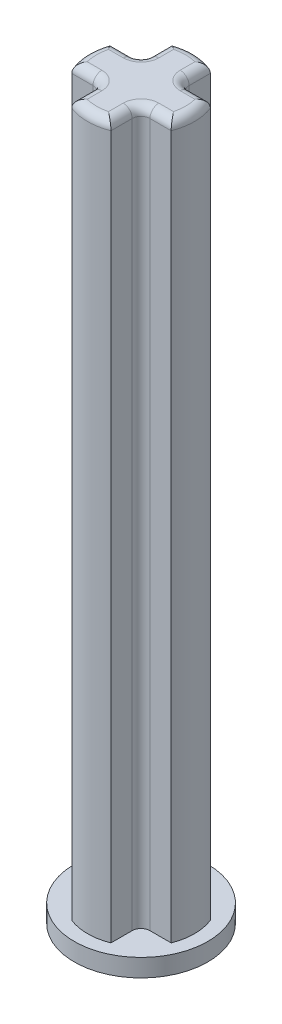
ISO-10303-21;
HEADER;
FILE_DESCRIPTION(('STEP AP214'),'2;1');
FILE_NAME('part.step','',(''),(''),'','','');
FILE_SCHEMA(('AUTOMOTIVE_DESIGN { 1 0 10303 214 1 1 1 1 }'));
ENDSEC;
DATA;
#1=APPLICATION_CONTEXT('core data for automotive mechanical design processes');
#2=APPLICATION_PROTOCOL_DEFINITION('international standard','automotive_design',2000,#1);
#3=PRODUCT_CONTEXT('',#1,'mechanical');
#4=PRODUCT('Part','Part','',(#3));
#5=PRODUCT_RELATED_PRODUCT_CATEGORY('part','',(#4));
#6=PRODUCT_DEFINITION_FORMATION('','',#4);
#7=PRODUCT_DEFINITION_CONTEXT('part definition',#1,'design');
#8=PRODUCT_DEFINITION('design','',#6,#7);
#9=PRODUCT_DEFINITION_SHAPE('','',#8);
#10=(LENGTH_UNIT() NAMED_UNIT(*) SI_UNIT(.MILLI.,.METRE.));
#11=(NAMED_UNIT(*) PLANE_ANGLE_UNIT() SI_UNIT($,.RADIAN.));
#12=(NAMED_UNIT(*) SI_UNIT($,.STERADIAN.) SOLID_ANGLE_UNIT());
#13=UNCERTAINTY_MEASURE_WITH_UNIT(LENGTH_MEASURE(1.E-05),#10,'distance_accuracy_value','');
#14=(GEOMETRIC_REPRESENTATION_CONTEXT(3) GLOBAL_UNCERTAINTY_ASSIGNED_CONTEXT((#13)) GLOBAL_UNIT_ASSIGNED_CONTEXT((#10,
#11,#12)) REPRESENTATION_CONTEXT('',''));
#15=CARTESIAN_POINT('',(0.,0.,0.));
#16=DIRECTION('',(0.,0.,1.));
#17=DIRECTION('',(1.,0.,0.));
#18=AXIS2_PLACEMENT_3D('',#15,#16,#17);
#19=CARTESIAN_POINT('',(-0.88,32.,-2.23284571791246));
#20=DIRECTION('',(1.,0.,0.));
#21=DIRECTION('',(0.,0.,-1.));
#22=AXIS2_PLACEMENT_3D('',#19,#20,#21);
#23=PLANE('',#22);
#24=DIRECTION('',(0.,-1.,0.));
#25=VECTOR('',#24,1.);
#26=CARTESIAN_POINT('',(-0.88,32.,-1.28));
#27=LINE('',#26,#25);
#28=CARTESIAN_POINT('',(-0.88,0.,-1.28));
#29=VERTEX_POINT('',#28);
#30=CARTESIAN_POINT('',(-0.88,31.6,-1.28));
#31=VERTEX_POINT('',#30);
#32=EDGE_CURVE('E62',#29,#31,#27,.F.);
#33=ORIENTED_EDGE('',*,*,#32,.T.);
#34=DIRECTION('',(0.,0.,1.));
#35=VECTOR('',#34,1.);
#36=CARTESIAN_POINT('',(-0.88,31.6,-2.23284571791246));
#37=LINE('',#36,#35);
#38=CARTESIAN_POINT('',(-0.88,31.6,-2.23284571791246));
#39=VERTEX_POINT('',#38);
#40=EDGE_CURVE('E214',#31,#39,#37,.F.);
#41=ORIENTED_EDGE('',*,*,#40,.T.);
#42=DIRECTION('',(0.,-1.,0.));
#43=VECTOR('',#42,1.);
#44=CARTESIAN_POINT('',(-0.88,32.,-2.23284571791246));
#45=LINE('',#44,#43);
#46=CARTESIAN_POINT('',(-0.88,0.,-2.23284571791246));
#47=VERTEX_POINT('',#46);
#48=EDGE_CURVE('E219',#39,#47,#45,.T.);
#49=ORIENTED_EDGE('',*,*,#48,.T.);
#50=DIRECTION('',(0.,0.,1.));
#51=VECTOR('',#50,1.);
#52=CARTESIAN_POINT('',(-0.88,0.,-2.23284571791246));
#53=LINE('',#52,#51);
#54=EDGE_CURVE('E217',#47,#29,#53,.T.);
#55=ORIENTED_EDGE('',*,*,#54,.T.);
#56=EDGE_LOOP('',(#33,#41,#49,#55));
#57=FACE_BOUND('',#56,.T.);
#58=ADVANCED_FACE('F39',(#57),#23,.F.);
#59=CARTESIAN_POINT('',(-2.23284571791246,32.,-0.88));
#60=DIRECTION('',(0.,0.,1.));
#61=DIRECTION('',(1.,0.,0.));
#62=AXIS2_PLACEMENT_3D('',#59,#60,#61);
#63=PLANE('',#62);
#64=DIRECTION('',(0.,-1.,0.));
#65=VECTOR('',#64,1.);
#66=CARTESIAN_POINT('',(-2.23284571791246,32.,-0.88));
#67=LINE('',#66,#65);
#68=CARTESIAN_POINT('',(-2.23284571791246,31.6,-0.88));
#69=VERTEX_POINT('',#68);
#70=CARTESIAN_POINT('',(-2.23284571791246,0.,-0.88));
#71=VERTEX_POINT('',#70);
#72=EDGE_CURVE('E291',#69,#71,#67,.T.);
#73=ORIENTED_EDGE('',*,*,#72,.F.);
#74=DIRECTION('',(-1.,0.,0.));
#75=VECTOR('',#74,1.);
#76=CARTESIAN_POINT('',(-0.88,31.6,-0.88));
#77=LINE('',#76,#75);
#78=CARTESIAN_POINT('',(-1.28,31.6,-0.88));
#79=VERTEX_POINT('',#78);
#80=EDGE_CURVE('E70',#69,#79,#77,.F.);
#81=ORIENTED_EDGE('',*,*,#80,.T.);
#82=DIRECTION('',(0.,-1.,0.));
#83=VECTOR('',#82,1.);
#84=CARTESIAN_POINT('',(-1.28,0.,-0.88));
#85=LINE('',#84,#83);
#86=CARTESIAN_POINT('',(-1.28,0.,-0.88));
#87=VERTEX_POINT('',#86);
#88=EDGE_CURVE('E396',#79,#87,#85,.T.);
#89=ORIENTED_EDGE('',*,*,#88,.T.);
#90=DIRECTION('',(-1.,0.,0.));
#91=VECTOR('',#90,1.);
#92=CARTESIAN_POINT('',(-2.23284571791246,0.,-0.88));
#93=LINE('',#92,#91);
#94=EDGE_CURVE('E224',#87,#71,#93,.T.);
#95=ORIENTED_EDGE('',*,*,#94,.T.);
#96=EDGE_LOOP('',(#73,#81,#89,#95));
#97=FACE_BOUND('',#96,.T.);
#98=ADVANCED_FACE('F572',(#97),#63,.F.);
#99=CARTESIAN_POINT('',(0.,32.,0.));
#100=DIRECTION('',(0.,-1.,0.));
#101=DIRECTION('',(0.,0.,-1.));
#102=AXIS2_PLACEMENT_3D('',#99,#100,#101);
#103=CYLINDRICAL_SURFACE('',#102,2.4);
#104=DIRECTION('',(0.,-1.,0.));
#105=VECTOR('',#104,1.);
#106=CARTESIAN_POINT('',(-2.23284571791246,32.,0.880000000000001));
#107=LINE('',#106,#105);
#108=CARTESIAN_POINT('',(-2.23284571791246,31.6,0.880000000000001));
#109=VERTEX_POINT('',#108);
#110=CARTESIAN_POINT('',(-2.23284571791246,0.,0.880000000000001));
#111=VERTEX_POINT('',#110);
#112=EDGE_CURVE('E288',#109,#111,#107,.T.);
#113=ORIENTED_EDGE('',*,*,#112,.F.);
#114=CARTESIAN_POINT('',(0.,31.6,0.));
#115=DIRECTION('',(0.,1.,0.));
#116=DIRECTION('',(0.,0.,1.));
#117=AXIS2_PLACEMENT_3D('',#114,#115,#116);
#118=CIRCLE('',#117,2.4);
#119=EDGE_CURVE('E393',#109,#69,#118,.F.);
#120=ORIENTED_EDGE('',*,*,#119,.T.);
#121=ORIENTED_EDGE('',*,*,#72,.T.);
#122=CARTESIAN_POINT('',(0.,0.,0.));
#123=DIRECTION('',(0.,1.,0.));
#124=DIRECTION('',(0.,0.,1.));
#125=AXIS2_PLACEMENT_3D('',#122,#123,#124);
#126=CIRCLE('',#125,2.4);
#127=EDGE_CURVE('E231',#71,#111,#126,.T.);
#128=ORIENTED_EDGE('',*,*,#127,.T.);
#129=EDGE_LOOP('',(#113,#120,#121,#128));
#130=FACE_BOUND('',#129,.T.);
#131=ADVANCED_FACE('F576',(#130),#103,.T.);
#132=CARTESIAN_POINT('',(-0.88,32.,0.880000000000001));
#133=DIRECTION('',(0.,0.,-1.));
#134=DIRECTION('',(-1.,0.,0.));
#135=AXIS2_PLACEMENT_3D('',#132,#133,#134);
#136=PLANE('',#135);
#137=DIRECTION('',(0.,-1.,0.));
#138=VECTOR('',#137,1.);
#139=CARTESIAN_POINT('',(-1.28,32.,0.880000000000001));
#140=LINE('',#139,#138);
#141=CARTESIAN_POINT('',(-1.28,0.,0.880000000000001));
#142=VERTEX_POINT('',#141);
#143=CARTESIAN_POINT('',(-1.28,31.6,0.880000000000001));
#144=VERTEX_POINT('',#143);
#145=EDGE_CURVE('E387',#142,#144,#140,.F.);
#146=ORIENTED_EDGE('',*,*,#145,.T.);
#147=DIRECTION('',(1.,0.,0.));
#148=VECTOR('',#147,1.);
#149=CARTESIAN_POINT('',(-2.23284571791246,31.6,0.880000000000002));
#150=LINE('',#149,#148);
#151=EDGE_CURVE('E390',#144,#109,#150,.F.);
#152=ORIENTED_EDGE('',*,*,#151,.T.);
#153=ORIENTED_EDGE('',*,*,#112,.T.);
#154=DIRECTION('',(1.,0.,0.));
#155=VECTOR('',#154,1.);
#156=CARTESIAN_POINT('',(-0.88,0.,0.880000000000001));
#157=LINE('',#156,#155);
#158=EDGE_CURVE('E236',#111,#142,#157,.T.);
#159=ORIENTED_EDGE('',*,*,#158,.T.);
#160=EDGE_LOOP('',(#146,#152,#153,#159));
#161=FACE_BOUND('',#160,.T.);
#162=ADVANCED_FACE('F581',(#161),#136,.F.);
#163=CARTESIAN_POINT('',(-0.88,32.,0.880000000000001));
#164=DIRECTION('',(1.,0.,0.));
#165=DIRECTION('',(0.,0.,-1.));
#166=AXIS2_PLACEMENT_3D('',#163,#164,#165);
#167=PLANE('',#166);
#168=DIRECTION('',(0.,-1.,0.));
#169=VECTOR('',#168,1.);
#170=CARTESIAN_POINT('',(-0.88,32.,2.23284571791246));
#171=LINE('',#170,#169);
#172=CARTESIAN_POINT('',(-0.88,31.6,2.23284571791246));
#173=VERTEX_POINT('',#172);
#174=CARTESIAN_POINT('',(-0.88,0.,2.23284571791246));
#175=VERTEX_POINT('',#174);
#176=EDGE_CURVE('E284',#173,#175,#171,.T.);
#177=ORIENTED_EDGE('',*,*,#176,.F.);
#178=DIRECTION('',(0.,0.,1.));
#179=VECTOR('',#178,1.);
#180=CARTESIAN_POINT('',(-0.88,31.6,0.880000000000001));
#181=LINE('',#180,#179);
#182=CARTESIAN_POINT('',(-0.88,31.6,1.28));
#183=VERTEX_POINT('',#182);
#184=EDGE_CURVE('E384',#173,#183,#181,.F.);
#185=ORIENTED_EDGE('',*,*,#184,.T.);
#186=DIRECTION('',(0.,-1.,0.));
#187=VECTOR('',#186,1.);
#188=CARTESIAN_POINT('',(-0.88,0.,1.28));
#189=LINE('',#188,#187);
#190=CARTESIAN_POINT('',(-0.88,0.,1.28));
#191=VERTEX_POINT('',#190);
#192=EDGE_CURVE('E381',#183,#191,#189,.T.);
#193=ORIENTED_EDGE('',*,*,#192,.T.);
#194=DIRECTION('',(0.,0.,1.));
#195=VECTOR('',#194,1.);
#196=CARTESIAN_POINT('',(-0.88,0.,0.880000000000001));
#197=LINE('',#196,#195);
#198=EDGE_CURVE('E242',#191,#175,#197,.T.);
#199=ORIENTED_EDGE('',*,*,#198,.T.);
#200=EDGE_LOOP('',(#177,#185,#193,#199));
#201=FACE_BOUND('',#200,.T.);
#202=ADVANCED_FACE('F585',(#201),#167,.F.);
#203=CARTESIAN_POINT('',(0.,32.,0.));
#204=DIRECTION('',(0.,-1.,0.));
#205=DIRECTION('',(0.,0.,-1.));
#206=AXIS2_PLACEMENT_3D('',#203,#204,#205);
#207=CYLINDRICAL_SURFACE('',#206,2.4);
#208=DIRECTION('',(0.,-1.,0.));
#209=VECTOR('',#208,1.);
#210=CARTESIAN_POINT('',(0.88,32.,2.23284571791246));
#211=LINE('',#210,#209);
#212=CARTESIAN_POINT('',(0.88,31.6,2.23284571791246));
#213=VERTEX_POINT('',#212);
#214=CARTESIAN_POINT('',(0.88,0.,2.23284571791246));
#215=VERTEX_POINT('',#214);
#216=EDGE_CURVE('E281',#213,#215,#211,.T.);
#217=ORIENTED_EDGE('',*,*,#216,.F.);
#218=CARTESIAN_POINT('',(0.,31.6,0.));
#219=DIRECTION('',(0.,1.,0.));
#220=DIRECTION('',(0.,0.,1.));
#221=AXIS2_PLACEMENT_3D('',#218,#219,#220);
#222=CIRCLE('',#221,2.4);
#223=EDGE_CURVE('E378',#213,#173,#222,.F.);
#224=ORIENTED_EDGE('',*,*,#223,.T.);
#225=ORIENTED_EDGE('',*,*,#176,.T.);
#226=CARTESIAN_POINT('',(0.,0.,0.));
#227=DIRECTION('',(0.,1.,0.));
#228=DIRECTION('',(0.,0.,1.));
#229=AXIS2_PLACEMENT_3D('',#226,#227,#228);
#230=CIRCLE('',#229,2.4);
#231=EDGE_CURVE('E245',#175,#215,#230,.T.);
#232=ORIENTED_EDGE('',*,*,#231,.T.);
#233=EDGE_LOOP('',(#217,#224,#225,#232));
#234=FACE_BOUND('',#233,.T.);
#235=ADVANCED_FACE('F589',(#234),#207,.T.);
#236=CARTESIAN_POINT('',(0.880000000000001,32.,2.23284571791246));
#237=DIRECTION('',(-1.,0.,0.));
#238=DIRECTION('',(0.,0.,1.));
#239=AXIS2_PLACEMENT_3D('',#236,#237,#238);
#240=PLANE('',#239);
#241=DIRECTION('',(0.,-1.,0.));
#242=VECTOR('',#241,1.);
#243=CARTESIAN_POINT('',(0.880000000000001,32.,1.28));
#244=LINE('',#243,#242);
#245=CARTESIAN_POINT('',(0.880000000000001,0.,1.28));
#246=VERTEX_POINT('',#245);
#247=CARTESIAN_POINT('',(0.880000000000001,31.6,1.28));
#248=VERTEX_POINT('',#247);
#249=EDGE_CURVE('E372',#246,#248,#244,.F.);
#250=ORIENTED_EDGE('',*,*,#249,.T.);
#251=DIRECTION('',(0.,0.,-1.));
#252=VECTOR('',#251,1.);
#253=CARTESIAN_POINT('',(0.880000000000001,31.6,2.23284571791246));
#254=LINE('',#253,#252);
#255=EDGE_CURVE('E375',#248,#213,#254,.F.);
#256=ORIENTED_EDGE('',*,*,#255,.T.);
#257=ORIENTED_EDGE('',*,*,#216,.T.);
#258=DIRECTION('',(0.,0.,-1.));
#259=VECTOR('',#258,1.);
#260=CARTESIAN_POINT('',(0.880000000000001,0.,2.23284571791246));
#261=LINE('',#260,#259);
#262=EDGE_CURVE('E249',#215,#246,#261,.T.);
#263=ORIENTED_EDGE('',*,*,#262,.T.);
#264=EDGE_LOOP('',(#250,#256,#257,#263));
#265=FACE_BOUND('',#264,.T.);
#266=ADVANCED_FACE('F593',(#265),#240,.F.);
#267=CARTESIAN_POINT('',(2.23284571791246,32.,0.880000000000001));
#268=DIRECTION('',(0.,0.,-1.));
#269=DIRECTION('',(-1.,0.,0.));
#270=AXIS2_PLACEMENT_3D('',#267,#268,#269);
#271=PLANE('',#270);
#272=DIRECTION('',(0.,-1.,0.));
#273=VECTOR('',#272,1.);
#274=CARTESIAN_POINT('',(2.23284571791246,32.,0.880000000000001));
#275=LINE('',#274,#273);
#276=CARTESIAN_POINT('',(2.23284571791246,31.6,0.880000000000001));
#277=VERTEX_POINT('',#276);
#278=CARTESIAN_POINT('',(2.23284571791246,0.,0.880000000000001));
#279=VERTEX_POINT('',#278);
#280=EDGE_CURVE('E277',#277,#279,#275,.T.);
#281=ORIENTED_EDGE('',*,*,#280,.F.);
#282=DIRECTION('',(1.,0.,0.));
#283=VECTOR('',#282,1.);
#284=CARTESIAN_POINT('',(0.880000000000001,31.6,0.880000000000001));
#285=LINE('',#284,#283);
#286=CARTESIAN_POINT('',(1.28,31.6,0.880000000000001));
#287=VERTEX_POINT('',#286);
#288=EDGE_CURVE('E369',#277,#287,#285,.F.);
#289=ORIENTED_EDGE('',*,*,#288,.T.);
#290=DIRECTION('',(0.,-1.,0.));
#291=VECTOR('',#290,1.);
#292=CARTESIAN_POINT('',(1.28,0.,0.880000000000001));
#293=LINE('',#292,#291);
#294=CARTESIAN_POINT('',(1.28,0.,0.880000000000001));
#295=VERTEX_POINT('',#294);
#296=EDGE_CURVE('E366',#287,#295,#293,.T.);
#297=ORIENTED_EDGE('',*,*,#296,.T.);
#298=DIRECTION('',(1.,0.,0.));
#299=VECTOR('',#298,1.);
#300=CARTESIAN_POINT('',(2.23284571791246,0.,0.880000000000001));
#301=LINE('',#300,#299);
#302=EDGE_CURVE('E252',#295,#279,#301,.T.);
#303=ORIENTED_EDGE('',*,*,#302,.T.);
#304=EDGE_LOOP('',(#281,#289,#297,#303));
#305=FACE_BOUND('',#304,.T.);
#306=ADVANCED_FACE('F597',(#305),#271,.F.);
#307=CARTESIAN_POINT('',(0.,32.,0.));
#308=DIRECTION('',(0.,-1.,0.));
#309=DIRECTION('',(0.,0.,-1.));
#310=AXIS2_PLACEMENT_3D('',#307,#308,#309);
#311=CYLINDRICAL_SURFACE('',#310,2.4);
#312=DIRECTION('',(0.,-1.,0.));
#313=VECTOR('',#312,1.);
#314=CARTESIAN_POINT('',(2.23284571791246,32.,-0.88));
#315=LINE('',#314,#313);
#316=CARTESIAN_POINT('',(2.23284571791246,31.6,-0.88));
#317=VERTEX_POINT('',#316);
#318=CARTESIAN_POINT('',(2.23284571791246,0.,-0.88));
#319=VERTEX_POINT('',#318);
#320=EDGE_CURVE('E274',#317,#319,#315,.T.);
#321=ORIENTED_EDGE('',*,*,#320,.F.);
#322=CARTESIAN_POINT('',(0.,31.6,0.));
#323=DIRECTION('',(0.,1.,0.));
#324=DIRECTION('',(0.,0.,1.));
#325=AXIS2_PLACEMENT_3D('',#322,#323,#324);
#326=CIRCLE('',#325,2.4);
#327=EDGE_CURVE('E363',#317,#277,#326,.F.);
#328=ORIENTED_EDGE('',*,*,#327,.T.);
#329=ORIENTED_EDGE('',*,*,#280,.T.);
#330=CARTESIAN_POINT('',(0.,0.,0.));
#331=DIRECTION('',(0.,1.,0.));
#332=DIRECTION('',(0.,0.,1.));
#333=AXIS2_PLACEMENT_3D('',#330,#331,#332);
#334=CIRCLE('',#333,2.4);
#335=EDGE_CURVE('E255',#279,#319,#334,.T.);
#336=ORIENTED_EDGE('',*,*,#335,.T.);
#337=EDGE_LOOP('',(#321,#328,#329,#336));
#338=FACE_BOUND('',#337,.T.);
#339=ADVANCED_FACE('F601',(#338),#311,.T.);
#340=CARTESIAN_POINT('',(0.880000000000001,32.,-0.88));
#341=DIRECTION('',(0.,0.,1.));
#342=DIRECTION('',(1.,0.,0.));
#343=AXIS2_PLACEMENT_3D('',#340,#341,#342);
#344=PLANE('',#343);
#345=DIRECTION('',(0.,-1.,0.));
#346=VECTOR('',#345,1.);
#347=CARTESIAN_POINT('',(1.28,32.,-0.88));
#348=LINE('',#347,#346);
#349=CARTESIAN_POINT('',(1.28,0.,-0.88));
#350=VERTEX_POINT('',#349);
#351=CARTESIAN_POINT('',(1.28,31.6,-0.88));
#352=VERTEX_POINT('',#351);
#353=EDGE_CURVE('E357',#350,#352,#348,.F.);
#354=ORIENTED_EDGE('',*,*,#353,.T.);
#355=DIRECTION('',(-1.,0.,0.));
#356=VECTOR('',#355,1.);
#357=CARTESIAN_POINT('',(2.23284571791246,31.6,-0.88));
#358=LINE('',#357,#356);
#359=EDGE_CURVE('E360',#352,#317,#358,.F.);
#360=ORIENTED_EDGE('',*,*,#359,.T.);
#361=ORIENTED_EDGE('',*,*,#320,.T.);
#362=DIRECTION('',(-1.,0.,0.));
#363=VECTOR('',#362,1.);
#364=CARTESIAN_POINT('',(0.880000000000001,0.,-0.88));
#365=LINE('',#364,#363);
#366=EDGE_CURVE('E259',#319,#350,#365,.T.);
#367=ORIENTED_EDGE('',*,*,#366,.T.);
#368=EDGE_LOOP('',(#354,#360,#361,#367));
#369=FACE_BOUND('',#368,.T.);
#370=ADVANCED_FACE('F605',(#369),#344,.F.);
#371=CARTESIAN_POINT('',(0.880000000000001,32.,-0.88));
#372=DIRECTION('',(-1.,0.,0.));
#373=DIRECTION('',(0.,0.,1.));
#374=AXIS2_PLACEMENT_3D('',#371,#372,#373);
#375=PLANE('',#374);
#376=DIRECTION('',(0.,-1.,0.));
#377=VECTOR('',#376,1.);
#378=CARTESIAN_POINT('',(0.880000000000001,32.,-2.23284571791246));
#379=LINE('',#378,#377);
#380=CARTESIAN_POINT('',(0.880000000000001,31.6,-2.23284571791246));
#381=VERTEX_POINT('',#380);
#382=CARTESIAN_POINT('',(0.880000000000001,0.,-2.23284571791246));
#383=VERTEX_POINT('',#382);
#384=EDGE_CURVE('E270',#381,#383,#379,.T.);
#385=ORIENTED_EDGE('',*,*,#384,.F.);
#386=DIRECTION('',(0.,0.,-1.));
#387=VECTOR('',#386,1.);
#388=CARTESIAN_POINT('',(0.880000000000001,31.6,-0.88));
#389=LINE('',#388,#387);
#390=CARTESIAN_POINT('',(0.880000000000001,31.6,-1.28));
#391=VERTEX_POINT('',#390);
#392=EDGE_CURVE('E354',#381,#391,#389,.F.);
#393=ORIENTED_EDGE('',*,*,#392,.T.);
#394=DIRECTION('',(0.,-1.,0.));
#395=VECTOR('',#394,1.);
#396=CARTESIAN_POINT('',(0.880000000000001,0.,-1.28));
#397=LINE('',#396,#395);
#398=CARTESIAN_POINT('',(0.880000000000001,0.,-1.28));
#399=VERTEX_POINT('',#398);
#400=EDGE_CURVE('E351',#391,#399,#397,.T.);
#401=ORIENTED_EDGE('',*,*,#400,.T.);
#402=DIRECTION('',(0.,0.,-1.));
#403=VECTOR('',#402,1.);
#404=CARTESIAN_POINT('',(0.880000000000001,0.,-0.88));
#405=LINE('',#404,#403);
#406=EDGE_CURVE('E262',#399,#383,#405,.T.);
#407=ORIENTED_EDGE('',*,*,#406,.T.);
#408=EDGE_LOOP('',(#385,#393,#401,#407));
#409=FACE_BOUND('',#408,.T.);
#410=ADVANCED_FACE('F609',(#409),#375,.F.);
#411=CARTESIAN_POINT('',(0.,32.,0.));
#412=DIRECTION('',(0.,-1.,0.));
#413=DIRECTION('',(0.,0.,-1.));
#414=AXIS2_PLACEMENT_3D('',#411,#412,#413);
#415=CYLINDRICAL_SURFACE('',#414,2.4);
#416=ORIENTED_EDGE('',*,*,#48,.F.);
#417=CARTESIAN_POINT('',(0.,31.6,0.));
#418=DIRECTION('',(0.,1.,0.));
#419=DIRECTION('',(0.,0.,1.));
#420=AXIS2_PLACEMENT_3D('',#417,#418,#419);
#421=CIRCLE('',#420,2.4);
#422=EDGE_CURVE('E347',#39,#381,#421,.F.);
#423=ORIENTED_EDGE('',*,*,#422,.T.);
#424=ORIENTED_EDGE('',*,*,#384,.T.);
#425=CARTESIAN_POINT('',(0.,0.,0.));
#426=DIRECTION('',(0.,1.,0.));
#427=DIRECTION('',(0.,0.,1.));
#428=AXIS2_PLACEMENT_3D('',#425,#426,#427);
#429=CIRCLE('',#428,2.4);
#430=EDGE_CURVE('E265',#383,#47,#429,.T.);
#431=ORIENTED_EDGE('',*,*,#430,.T.);
#432=EDGE_LOOP('',(#416,#423,#424,#431));
#433=FACE_BOUND('',#432,.T.);
#434=ADVANCED_FACE('F613',(#433),#415,.T.);
#435=CARTESIAN_POINT('',(0.,32.,0.));
#436=DIRECTION('',(0.,1.,0.));
#437=DIRECTION('',(0.,0.,1.));
#438=AXIS2_PLACEMENT_3D('',#435,#436,#437);
#439=PLANE('',#438);
#440=CARTESIAN_POINT('',(0.,32.,0.));
#441=DIRECTION('',(0.,1.,0.));
#442=DIRECTION('',(0.,0.,1.));
#443=AXIS2_PLACEMENT_3D('',#440,#441,#442);
#444=CIRCLE('',#443,2.);
#445=CARTESIAN_POINT('',(1.94154577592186,32.,0.480000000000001));
#446=VERTEX_POINT('',#445);
#447=CARTESIAN_POINT('',(1.94154577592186,32.,-0.48));
#448=VERTEX_POINT('',#447);
#449=EDGE_CURVE('E337',#446,#448,#444,.T.);
#450=ORIENTED_EDGE('',*,*,#449,.T.);
#451=DIRECTION('',(-1.,0.,0.));
#452=VECTOR('',#451,1.);
#453=CARTESIAN_POINT('',(0.880000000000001,32.,-0.48));
#454=LINE('',#453,#452);
#455=CARTESIAN_POINT('',(1.28,32.,-0.48));
#456=VERTEX_POINT('',#455);
#457=EDGE_CURVE('E344',#448,#456,#454,.T.);
#458=ORIENTED_EDGE('',*,*,#457,.T.);
#459=CARTESIAN_POINT('',(1.28,32.,-1.28));
#460=DIRECTION('',(0.,1.,0.));
#461=DIRECTION('',(0.,0.,1.));
#462=AXIS2_PLACEMENT_3D('',#459,#460,#461);
#463=CIRCLE('',#462,0.8);
#464=CARTESIAN_POINT('',(0.480000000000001,32.,-1.28));
#465=VERTEX_POINT('',#464);
#466=EDGE_CURVE('E340',#465,#456,#463,.T.);
#467=ORIENTED_EDGE('',*,*,#466,.F.);
#468=DIRECTION('',(0.,0.,-1.));
#469=VECTOR('',#468,1.);
#470=CARTESIAN_POINT('',(0.480000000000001,32.,-2.23284571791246));
#471=LINE('',#470,#469);
#472=CARTESIAN_POINT('',(0.480000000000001,32.,-1.94154577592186));
#473=VERTEX_POINT('',#472);
#474=EDGE_CURVE('E327',#465,#473,#471,.T.);
#475=ORIENTED_EDGE('',*,*,#474,.T.);
#476=CARTESIAN_POINT('',(0.,32.,0.));
#477=DIRECTION('',(0.,1.,0.));
#478=DIRECTION('',(0.,0.,1.));
#479=AXIS2_PLACEMENT_3D('',#476,#477,#478);
#480=CIRCLE('',#479,2.);
#481=CARTESIAN_POINT('',(-0.48,32.,-1.94154577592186));
#482=VERTEX_POINT('',#481);
#483=EDGE_CURVE('E310',#473,#482,#480,.T.);
#484=ORIENTED_EDGE('',*,*,#483,.T.);
#485=DIRECTION('',(0.,0.,1.));
#486=VECTOR('',#485,1.);
#487=CARTESIAN_POINT('',(-0.48,32.,-0.88));
#488=LINE('',#487,#486);
#489=CARTESIAN_POINT('',(-0.48,32.,-1.28));
#490=VERTEX_POINT('',#489);
#491=EDGE_CURVE('E298',#482,#490,#488,.T.);
#492=ORIENTED_EDGE('',*,*,#491,.T.);
#493=CARTESIAN_POINT('',(-1.28,32.,-1.28));
#494=DIRECTION('',(0.,1.,0.));
#495=DIRECTION('',(0.,0.,1.));
#496=AXIS2_PLACEMENT_3D('',#493,#494,#495);
#497=CIRCLE('',#496,0.8);
#498=CARTESIAN_POINT('',(-1.28,32.,-0.48));
#499=VERTEX_POINT('',#498);
#500=EDGE_CURVE('E294',#499,#490,#497,.T.);
#501=ORIENTED_EDGE('',*,*,#500,.F.);
#502=DIRECTION('',(-1.,0.,0.));
#503=VECTOR('',#502,1.);
#504=CARTESIAN_POINT('',(-2.23284571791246,32.,-0.48));
#505=LINE('',#504,#503);
#506=CARTESIAN_POINT('',(-1.94154577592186,32.,-0.48));
#507=VERTEX_POINT('',#506);
#508=EDGE_CURVE('E301',#499,#507,#505,.T.);
#509=ORIENTED_EDGE('',*,*,#508,.T.);
#510=CARTESIAN_POINT('',(0.,32.,0.));
#511=DIRECTION('',(0.,1.,0.));
#512=DIRECTION('',(0.,0.,1.));
#513=AXIS2_PLACEMENT_3D('',#510,#511,#512);
#514=CIRCLE('',#513,2.);
#515=CARTESIAN_POINT('',(-1.94154577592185,32.,0.480000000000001));
#516=VERTEX_POINT('',#515);
#517=EDGE_CURVE('E304',#507,#516,#514,.T.);
#518=ORIENTED_EDGE('',*,*,#517,.T.);
#519=DIRECTION('',(1.,0.,0.));
#520=VECTOR('',#519,1.);
#521=CARTESIAN_POINT('',(-0.88,32.,0.480000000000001));
#522=LINE('',#521,#520);
#523=CARTESIAN_POINT('',(-1.28,32.,0.480000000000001));
#524=VERTEX_POINT('',#523);
#525=EDGE_CURVE('E307',#516,#524,#522,.T.);
#526=ORIENTED_EDGE('',*,*,#525,.T.);
#527=CARTESIAN_POINT('',(-1.28,32.,1.28));
#528=DIRECTION('',(0.,1.,0.));
#529=DIRECTION('',(0.,0.,1.));
#530=AXIS2_PLACEMENT_3D('',#527,#528,#529);
#531=CIRCLE('',#530,0.8);
#532=CARTESIAN_POINT('',(-0.48,32.,1.28));
#533=VERTEX_POINT('',#532);
#534=EDGE_CURVE('E314',#533,#524,#531,.T.);
#535=ORIENTED_EDGE('',*,*,#534,.F.);
#536=DIRECTION('',(0.,0.,1.));
#537=VECTOR('',#536,1.);
#538=CARTESIAN_POINT('',(-0.48,32.,2.23284571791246));
#539=LINE('',#538,#537);
#540=CARTESIAN_POINT('',(-0.48,32.,1.94154577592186));
#541=VERTEX_POINT('',#540);
#542=EDGE_CURVE('E318',#533,#541,#539,.T.);
#543=ORIENTED_EDGE('',*,*,#542,.T.);
#544=CARTESIAN_POINT('',(0.,32.,0.));
#545=DIRECTION('',(0.,1.,0.));
#546=DIRECTION('',(0.,0.,1.));
#547=AXIS2_PLACEMENT_3D('',#544,#545,#546);
#548=CIRCLE('',#547,2.);
#549=CARTESIAN_POINT('',(0.48,32.,1.94154577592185));
#550=VERTEX_POINT('',#549);
#551=EDGE_CURVE('E321',#541,#550,#548,.T.);
#552=ORIENTED_EDGE('',*,*,#551,.T.);
#553=DIRECTION('',(0.,0.,-1.));
#554=VECTOR('',#553,1.);
#555=CARTESIAN_POINT('',(0.480000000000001,32.,0.880000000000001));
#556=LINE('',#555,#554);
#557=CARTESIAN_POINT('',(0.480000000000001,32.,1.28));
#558=VERTEX_POINT('',#557);
#559=EDGE_CURVE('E324',#550,#558,#556,.T.);
#560=ORIENTED_EDGE('',*,*,#559,.T.);
#561=CARTESIAN_POINT('',(1.28,32.,1.28));
#562=DIRECTION('',(0.,1.,0.));
#563=DIRECTION('',(0.,0.,1.));
#564=AXIS2_PLACEMENT_3D('',#561,#562,#563);
#565=CIRCLE('',#564,0.8);
#566=CARTESIAN_POINT('',(1.28,32.,0.480000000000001));
#567=VERTEX_POINT('',#566);
#568=EDGE_CURVE('E330',#567,#558,#565,.T.);
#569=ORIENTED_EDGE('',*,*,#568,.F.);
#570=DIRECTION('',(1.,0.,0.));
#571=VECTOR('',#570,1.);
#572=CARTESIAN_POINT('',(2.23284571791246,32.,0.480000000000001));
#573=LINE('',#572,#571);
#574=EDGE_CURVE('E334',#567,#446,#573,.T.);
#575=ORIENTED_EDGE('',*,*,#574,.T.);
#576=EDGE_LOOP('',(#450,#458,#467,#475,#484,#492,#501,#509,#518,#526,#535,#543,#552,#560,#569,#575));
#577=FACE_BOUND('',#576,.T.);
#578=ADVANCED_FACE('F556',(#577),#439,.T.);
#579=CARTESIAN_POINT('',(0.,31.6,0.));
#580=DIRECTION('',(0.,1.,0.));
#581=DIRECTION('',(0.,0.,1.));
#582=AXIS2_PLACEMENT_3D('',#579,#580,#581);
#583=TOROIDAL_SURFACE('',#582,2.,0.4);
#584=CARTESIAN_POINT('',(-0.88,31.6,2.23284571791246));
#585=CARTESIAN_POINT('',(-0.880027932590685,31.6196677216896,2.23286229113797));
#586=CARTESIAN_POINT('',(-0.878551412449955,31.6393093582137,2.23185960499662));
#587=CARTESIAN_POINT('',(-0.872817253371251,31.6778900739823,2.22795221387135));
#588=CARTESIAN_POINT('',(-0.868573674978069,31.6968321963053,2.22505712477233));
#589=CARTESIAN_POINT('',(-0.857535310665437,31.7335523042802,2.21750324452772));
#590=CARTESIAN_POINT('',(-0.850743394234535,31.7513315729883,2.21284643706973));
#591=CARTESIAN_POINT('',(-0.834948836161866,31.7853742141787,2.20197052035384));
#592=CARTESIAN_POINT('',(-0.82594396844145,31.8016360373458,2.19574983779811));
#593=CARTESIAN_POINT('',(-0.805515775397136,31.8332696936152,2.18156387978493));
#594=CARTESIAN_POINT('',(-0.793981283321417,31.8485327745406,2.1735174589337));
#595=CARTESIAN_POINT('',(-0.769295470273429,31.8768786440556,2.15618491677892));
#596=CARTESIAN_POINT('',(-0.756143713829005,31.8899608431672,2.14689846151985));
#597=CARTESIAN_POINT('',(-0.726380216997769,31.9158258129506,2.12572929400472));
#598=CARTESIAN_POINT('',(-0.709553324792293,31.9282155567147,2.11366981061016));
#599=CARTESIAN_POINT('',(-0.674765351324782,31.9499832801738,2.08850314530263));
#600=CARTESIAN_POINT('',(-0.656803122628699,31.9593581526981,2.07539489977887));
#601=CARTESIAN_POINT('',(-0.616725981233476,31.9766538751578,2.04585046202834));
#602=CARTESIAN_POINT('',(-0.594467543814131,31.9839655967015,2.02925334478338));
#603=CARTESIAN_POINT('',(-0.549587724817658,31.9945738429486,1.99535297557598));
#604=CARTESIAN_POINT('',(-0.526966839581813,31.9978754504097,1.97805064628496));
#605=CARTESIAN_POINT('',(-0.497330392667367,31.9996873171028,1.95507409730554));
#606=CARTESIAN_POINT('',(-0.490258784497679,31.9999307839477,1.9495684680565));
#607=CARTESIAN_POINT('',(-0.482131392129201,31.9999957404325,1.94321386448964));
#608=CARTESIAN_POINT('',(-0.481065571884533,31.9999999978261,1.94237999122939));
#609=CARTESIAN_POINT('',(-0.48,32.,1.94154577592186));
#610=B_SPLINE_CURVE_WITH_KNOTS('',3,(#584,#585,#586,#587,#588,#589,#590,#591,#592,#593,#594,
#595,#596,#597,#598,#599,#600,#601,#602,#603,#604,#605,#606,#607,#608,#609),.UNSPECIFIED.,.F.,
.F.,(4,2,2,2,2,2,2,2,2,2,2,2,4),(0.,0.0588812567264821,0.117465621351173,0.175984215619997,
0.234561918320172,0.296588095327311,0.358631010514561,0.430741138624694,0.502925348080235,
0.588744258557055,0.674454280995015,0.701345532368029,0.705405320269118),.UNSPECIFIED.);
#611=EDGE_CURVE('E542',#173,#541,#610,.T.);
#612=ORIENTED_EDGE('',*,*,#611,.F.);
#613=ORIENTED_EDGE('',*,*,#223,.F.);
#614=CARTESIAN_POINT('',(0.88,31.6,2.23284571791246));
#615=CARTESIAN_POINT('',(0.880027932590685,31.6196677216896,2.23286229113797));
#616=CARTESIAN_POINT('',(0.878551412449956,31.6393093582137,2.23185960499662));
#617=CARTESIAN_POINT('',(0.872817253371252,31.6778900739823,2.22795221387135));
#618=CARTESIAN_POINT('',(0.86857367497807,31.6968321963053,2.22505712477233));
#619=CARTESIAN_POINT('',(0.857535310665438,31.7335523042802,2.21750324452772));
#620=CARTESIAN_POINT('',(0.850743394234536,31.7513315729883,2.21284643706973));
#621=CARTESIAN_POINT('',(0.834948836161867,31.7853742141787,2.20197052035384));
#622=CARTESIAN_POINT('',(0.825943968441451,31.8016360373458,2.19574983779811));
#623=CARTESIAN_POINT('',(0.805515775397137,31.8332696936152,2.18156387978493));
#624=CARTESIAN_POINT('',(0.793981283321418,31.8485327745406,2.1735174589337));
#625=CARTESIAN_POINT('',(0.76929547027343,31.8768786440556,2.15618491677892));
#626=CARTESIAN_POINT('',(0.756143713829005,31.8899608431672,2.14689846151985));
#627=CARTESIAN_POINT('',(0.726380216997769,31.9158258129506,2.12572929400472));
#628=CARTESIAN_POINT('',(0.709553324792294,31.9282155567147,2.11366981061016));
#629=CARTESIAN_POINT('',(0.674765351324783,31.9499832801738,2.08850314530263));
#630=CARTESIAN_POINT('',(0.6568031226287,31.9593581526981,2.07539489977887));
#631=CARTESIAN_POINT('',(0.616725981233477,31.9766538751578,2.04585046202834));
#632=CARTESIAN_POINT('',(0.594467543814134,31.9839655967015,2.02925334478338));
#633=CARTESIAN_POINT('',(0.549587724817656,31.9945738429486,1.99535297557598));
#634=CARTESIAN_POINT('',(0.526966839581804,31.9978754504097,1.97805064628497));
#635=CARTESIAN_POINT('',(0.49733039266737,31.9996873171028,1.95507409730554));
#636=CARTESIAN_POINT('',(0.490258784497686,31.9999307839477,1.9495684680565));
#637=CARTESIAN_POINT('',(0.482131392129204,31.9999957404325,1.94321386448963));
#638=CARTESIAN_POINT('',(0.481065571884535,31.9999999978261,1.94237999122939));
#639=CARTESIAN_POINT('',(0.480000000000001,32.,1.94154577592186));
#640=B_SPLINE_CURVE_WITH_KNOTS('',3,(#614,#615,#616,#617,#618,#619,#620,#621,#622,#623,#624,
#625,#626,#627,#628,#629,#630,#631,#632,#633,#634,#635,#636,#637,#638,#639),.UNSPECIFIED.,.F.,
.F.,(4,2,2,2,2,2,2,2,2,2,2,2,4),(0.,0.058881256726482,0.117465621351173,0.175984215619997,
0.234561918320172,0.296588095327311,0.358631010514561,0.430741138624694,0.502925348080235,
0.588744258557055,0.674454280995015,0.701345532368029,0.705405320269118),.UNSPECIFIED.);
#641=EDGE_CURVE('E43',#550,#213,#640,.F.);
#642=ORIENTED_EDGE('',*,*,#641,.F.);
#643=ORIENTED_EDGE('',*,*,#551,.F.);
#644=EDGE_LOOP('',(#612,#613,#642,#643));
#645=FACE_BOUND('',#644,.T.);
#646=ADVANCED_FACE('F553',(#645),#583,.T.);
#647=CARTESIAN_POINT('',(1.28,32.,1.28));
#648=DIRECTION('',(0.,1.,0.));
#649=DIRECTION('',(0.,0.,1.));
#650=AXIS2_PLACEMENT_3D('',#647,#648,#649);
#651=CYLINDRICAL_SURFACE('',#650,0.4);
#652=CARTESIAN_POINT('',(1.28,0.,1.28));
#653=DIRECTION('',(0.,1.,0.));
#654=DIRECTION('',(0.,0.,1.));
#655=AXIS2_PLACEMENT_3D('',#652,#653,#654);
#656=CIRCLE('',#655,0.4);
#657=EDGE_CURVE('E407',#295,#246,#656,.T.);
#658=ORIENTED_EDGE('',*,*,#657,.F.);
#659=ORIENTED_EDGE('',*,*,#296,.F.);
#660=CARTESIAN_POINT('',(1.28,31.6,1.28));
#661=DIRECTION('',(0.,1.,0.));
#662=DIRECTION('',(0.,0.,1.));
#663=AXIS2_PLACEMENT_3D('',#660,#661,#662);
#664=CIRCLE('',#663,0.4);
#665=EDGE_CURVE('E539',#248,#287,#664,.F.);
#666=ORIENTED_EDGE('',*,*,#665,.F.);
#667=ORIENTED_EDGE('',*,*,#249,.F.);
#668=EDGE_LOOP('',(#658,#659,#666,#667));
#669=FACE_BOUND('',#668,.T.);
#670=ADVANCED_FACE('F41',(#669),#651,.F.);
#671=CARTESIAN_POINT('',(0.480000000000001,31.6,0.));
#672=DIRECTION('',(0.,0.,1.));
#673=DIRECTION('',(1.,0.,0.));
#674=AXIS2_PLACEMENT_3D('',#671,#672,#673);
#675=CYLINDRICAL_SURFACE('',#674,0.4);
#676=ORIENTED_EDGE('',*,*,#641,.T.);
#677=ORIENTED_EDGE('',*,*,#255,.F.);
#678=CARTESIAN_POINT('',(0.480000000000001,31.6,1.28));
#679=DIRECTION('',(0.,0.,-1.));
#680=DIRECTION('',(-1.,0.,0.));
#681=AXIS2_PLACEMENT_3D('',#678,#679,#680);
#682=CIRCLE('',#681,0.4);
#683=EDGE_CURVE('E535',#558,#248,#682,.T.);
#684=ORIENTED_EDGE('',*,*,#683,.F.);
#685=ORIENTED_EDGE('',*,*,#559,.F.);
#686=EDGE_LOOP('',(#676,#677,#684,#685));
#687=FACE_BOUND('',#686,.T.);
#688=ADVANCED_FACE('F558',(#687),#675,.T.);
#689=CARTESIAN_POINT('',(-0.48,31.6,0.));
#690=DIRECTION('',(0.,0.,-1.));
#691=DIRECTION('',(-1.,0.,0.));
#692=AXIS2_PLACEMENT_3D('',#689,#690,#691);
#693=CYLINDRICAL_SURFACE('',#692,0.4);
#694=ORIENTED_EDGE('',*,*,#611,.T.);
#695=ORIENTED_EDGE('',*,*,#542,.F.);
#696=CARTESIAN_POINT('',(-0.48,31.6,1.28));
#697=DIRECTION('',(0.,0.,-1.));
#698=DIRECTION('',(-1.,0.,0.));
#699=AXIS2_PLACEMENT_3D('',#696,#697,#698);
#700=CIRCLE('',#699,0.4);
#701=EDGE_CURVE('E531',#183,#533,#700,.T.);
#702=ORIENTED_EDGE('',*,*,#701,.F.);
#703=ORIENTED_EDGE('',*,*,#184,.F.);
#704=EDGE_LOOP('',(#694,#695,#702,#703));
#705=FACE_BOUND('',#704,.T.);
#706=ADVANCED_FACE('F550',(#705),#693,.T.);
#707=CARTESIAN_POINT('',(-1.28,32.,1.28));
#708=DIRECTION('',(0.,1.,0.));
#709=DIRECTION('',(0.,0.,1.));
#710=AXIS2_PLACEMENT_3D('',#707,#708,#709);
#711=CYLINDRICAL_SURFACE('',#710,0.4);
#712=CARTESIAN_POINT('',(-1.28,0.,1.28));
#713=DIRECTION('',(0.,1.,0.));
#714=DIRECTION('',(0.,0.,1.));
#715=AXIS2_PLACEMENT_3D('',#712,#713,#714);
#716=CIRCLE('',#715,0.4);
#717=EDGE_CURVE('E403',#191,#142,#716,.T.);
#718=ORIENTED_EDGE('',*,*,#717,.F.);
#719=ORIENTED_EDGE('',*,*,#192,.F.);
#720=CARTESIAN_POINT('',(-1.28,31.6,1.28));
#721=DIRECTION('',(0.,1.,0.));
#722=DIRECTION('',(0.,0.,1.));
#723=AXIS2_PLACEMENT_3D('',#720,#721,#722);
#724=CIRCLE('',#723,0.4);
#725=EDGE_CURVE('E527',#144,#183,#724,.F.);
#726=ORIENTED_EDGE('',*,*,#725,.F.);
#727=ORIENTED_EDGE('',*,*,#145,.F.);
#728=EDGE_LOOP('',(#718,#719,#726,#727));
#729=FACE_BOUND('',#728,.T.);
#730=ADVANCED_FACE('F567',(#729),#711,.F.);
#731=CARTESIAN_POINT('',(1.28,31.6,1.28));
#732=DIRECTION('',(0.,1.,0.));
#733=DIRECTION('',(0.,0.,1.));
#734=AXIS2_PLACEMENT_3D('',#731,#732,#733);
#735=TOROIDAL_SURFACE('',#734,0.8,0.4);
#736=ORIENTED_EDGE('',*,*,#683,.T.);
#737=ORIENTED_EDGE('',*,*,#665,.T.);
#738=CARTESIAN_POINT('',(1.28,31.6,0.480000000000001));
#739=DIRECTION('',(-1.,0.,0.));
#740=DIRECTION('',(0.,0.,1.));
#741=AXIS2_PLACEMENT_3D('',#738,#739,#740);
#742=CIRCLE('',#741,0.4);
#743=EDGE_CURVE('E523',#567,#287,#742,.F.);
#744=ORIENTED_EDGE('',*,*,#743,.F.);
#745=ORIENTED_EDGE('',*,*,#568,.T.);
#746=EDGE_LOOP('',(#736,#737,#744,#745));
#747=FACE_BOUND('',#746,.T.);
#748=ADVANCED_FACE('F685',(#747),#735,.T.);
#749=CARTESIAN_POINT('',(-1.28,31.6,1.28));
#750=DIRECTION('',(0.,1.,0.));
#751=DIRECTION('',(0.,0.,1.));
#752=AXIS2_PLACEMENT_3D('',#749,#750,#751);
#753=TOROIDAL_SURFACE('',#752,0.8,0.4);
#754=ORIENTED_EDGE('',*,*,#701,.T.);
#755=ORIENTED_EDGE('',*,*,#534,.T.);
#756=CARTESIAN_POINT('',(-1.28,31.6,0.480000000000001));
#757=DIRECTION('',(1.,0.,0.));
#758=DIRECTION('',(0.,0.,-1.));
#759=AXIS2_PLACEMENT_3D('',#756,#757,#758);
#760=CIRCLE('',#759,0.4);
#761=EDGE_CURVE('E519',#144,#524,#760,.F.);
#762=ORIENTED_EDGE('',*,*,#761,.F.);
#763=ORIENTED_EDGE('',*,*,#725,.T.);
#764=EDGE_LOOP('',(#754,#755,#762,#763));
#765=FACE_BOUND('',#764,.T.);
#766=ADVANCED_FACE('F508',(#765),#753,.T.);
#767=CARTESIAN_POINT('',(0.,31.6,0.480000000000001));
#768=DIRECTION('',(-1.,0.,0.));
#769=DIRECTION('',(0.,0.,1.));
#770=AXIS2_PLACEMENT_3D('',#767,#768,#769);
#771=CYLINDRICAL_SURFACE('',#770,0.4);
#772=ORIENTED_EDGE('',*,*,#743,.T.);
#773=ORIENTED_EDGE('',*,*,#288,.F.);
#774=CARTESIAN_POINT('',(2.23284571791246,31.6,0.880000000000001));
#775=CARTESIAN_POINT('',(2.23286229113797,31.6196677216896,0.880027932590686));
#776=CARTESIAN_POINT('',(2.23185960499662,31.6393093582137,0.878551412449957));
#777=CARTESIAN_POINT('',(2.22795221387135,31.6778900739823,0.872817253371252));
#778=CARTESIAN_POINT('',(2.22505712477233,31.6968321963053,0.86857367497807));
#779=CARTESIAN_POINT('',(2.21750324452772,31.7335523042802,0.85753531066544));
#780=CARTESIAN_POINT('',(2.21284643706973,31.7513315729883,0.850743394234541));
#781=CARTESIAN_POINT('',(2.20197052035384,31.7853742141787,0.834948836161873));
#782=CARTESIAN_POINT('',(2.19574983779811,31.8016360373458,0.825943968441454));
#783=CARTESIAN_POINT('',(2.18156387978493,31.8332696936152,0.805515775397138));
#784=CARTESIAN_POINT('',(2.1735174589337,31.8485327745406,0.793981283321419));
#785=CARTESIAN_POINT('',(2.15618491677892,31.8768786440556,0.769295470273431));
#786=CARTESIAN_POINT('',(2.14689846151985,31.8899608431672,0.756143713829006));
#787=CARTESIAN_POINT('',(2.12572929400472,31.9158258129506,0.72638021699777));
#788=CARTESIAN_POINT('',(2.11366981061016,31.9282155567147,0.709553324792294));
#789=CARTESIAN_POINT('',(2.08850314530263,31.9499832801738,0.674765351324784));
#790=CARTESIAN_POINT('',(2.07539489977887,31.9593581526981,0.6568031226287));
#791=CARTESIAN_POINT('',(2.04585046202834,31.9766538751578,0.616725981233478));
#792=CARTESIAN_POINT('',(2.02925334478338,31.9839655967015,0.594467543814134));
#793=CARTESIAN_POINT('',(1.99535297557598,31.9945738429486,0.549587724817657));
#794=CARTESIAN_POINT('',(1.97805064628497,31.9978754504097,0.526966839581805));
#795=CARTESIAN_POINT('',(1.95507409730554,31.9996873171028,0.49733039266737));
#796=CARTESIAN_POINT('',(1.9495684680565,31.9999307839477,0.490258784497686));
#797=CARTESIAN_POINT('',(1.94321386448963,31.9999957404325,0.482131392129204));
#798=CARTESIAN_POINT('',(1.94237999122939,31.9999999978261,0.481065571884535));
#799=CARTESIAN_POINT('',(1.94154577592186,32.,0.480000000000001));
#800=B_SPLINE_CURVE_WITH_KNOTS('',3,(#774,#775,#776,#777,#778,#779,#780,#781,#782,#783,#784,
#785,#786,#787,#788,#789,#790,#791,#792,#793,#794,#795,#796,#797,#798,#799),.UNSPECIFIED.,.F.,
.F.,(4,2,2,2,2,2,2,2,2,2,2,2,4),(0.,0.0588812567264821,0.117465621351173,0.175984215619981,
0.234561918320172,0.296588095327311,0.358631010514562,0.430741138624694,0.502925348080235,
0.588744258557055,0.674454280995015,0.701345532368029,0.705405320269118),.UNSPECIFIED.);
#801=EDGE_CURVE('E511',#446,#277,#800,.F.);
#802=ORIENTED_EDGE('',*,*,#801,.F.);
#803=ORIENTED_EDGE('',*,*,#574,.F.);
#804=EDGE_LOOP('',(#772,#773,#802,#803));
#805=FACE_BOUND('',#804,.T.);
#806=ADVANCED_FACE('F503',(#805),#771,.T.);
#807=CARTESIAN_POINT('',(0.,31.6,0.480000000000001));
#808=DIRECTION('',(-1.,0.,0.));
#809=DIRECTION('',(0.,0.,1.));
#810=AXIS2_PLACEMENT_3D('',#807,#808,#809);
#811=CYLINDRICAL_SURFACE('',#810,0.4);
#812=ORIENTED_EDGE('',*,*,#761,.T.);
#813=ORIENTED_EDGE('',*,*,#525,.F.);
#814=CARTESIAN_POINT('',(-2.23284571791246,31.6,0.880000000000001));
#815=CARTESIAN_POINT('',(-2.23286229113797,31.6196677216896,0.880027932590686));
#816=CARTESIAN_POINT('',(-2.23185960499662,31.6393093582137,0.878551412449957));
#817=CARTESIAN_POINT('',(-2.22795221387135,31.6778900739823,0.872817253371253));
#818=CARTESIAN_POINT('',(-2.22505712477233,31.6968321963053,0.868573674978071));
#819=CARTESIAN_POINT('',(-2.21750324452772,31.7335523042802,0.857535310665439));
#820=CARTESIAN_POINT('',(-2.21284643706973,31.7513315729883,0.850743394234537));
#821=CARTESIAN_POINT('',(-2.20197052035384,31.7853742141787,0.834948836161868));
#822=CARTESIAN_POINT('',(-2.19574983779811,31.8016360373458,0.825943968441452));
#823=CARTESIAN_POINT('',(-2.18156387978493,31.8332696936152,0.805515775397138));
#824=CARTESIAN_POINT('',(-2.1735174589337,31.8485327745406,0.793981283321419));
#825=CARTESIAN_POINT('',(-2.15618491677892,31.8768786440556,0.769295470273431));
#826=CARTESIAN_POINT('',(-2.14689846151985,31.8899608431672,0.756143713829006));
#827=CARTESIAN_POINT('',(-2.12572929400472,31.9158258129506,0.72638021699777));
#828=CARTESIAN_POINT('',(-2.11366981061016,31.9282155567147,0.709553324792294));
#829=CARTESIAN_POINT('',(-2.08850314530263,31.9499832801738,0.674765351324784));
#830=CARTESIAN_POINT('',(-2.07539489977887,31.9593581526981,0.656803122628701));
#831=CARTESIAN_POINT('',(-2.04585046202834,31.9766538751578,0.616725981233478));
#832=CARTESIAN_POINT('',(-2.02925334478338,31.9839655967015,0.594467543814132));
#833=CARTESIAN_POINT('',(-1.99535297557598,31.9945738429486,0.549587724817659));
#834=CARTESIAN_POINT('',(-1.97805064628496,31.9978754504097,0.526966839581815));
#835=CARTESIAN_POINT('',(-1.95507409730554,31.9996873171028,0.497330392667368));
#836=CARTESIAN_POINT('',(-1.9495684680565,31.9999307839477,0.49025878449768));
#837=CARTESIAN_POINT('',(-1.94321386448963,31.9999957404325,0.482131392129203));
#838=CARTESIAN_POINT('',(-1.94237999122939,31.9999999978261,0.481065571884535));
#839=CARTESIAN_POINT('',(-1.94154577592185,32.,0.480000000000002));
#840=B_SPLINE_CURVE_WITH_KNOTS('',3,(#814,#815,#816,#817,#818,#819,#820,#821,#822,#823,#824,
#825,#826,#827,#828,#829,#830,#831,#832,#833,#834,#835,#836,#837,#838,#839),.UNSPECIFIED.,.F.,
.F.,(4,2,2,2,2,2,2,2,2,2,2,2,4),(0.,0.0588812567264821,0.117465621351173,0.175984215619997,
0.234561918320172,0.296588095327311,0.358631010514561,0.430741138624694,0.502925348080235,
0.588744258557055,0.674454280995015,0.701345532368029,0.705405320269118),.UNSPECIFIED.);
#841=EDGE_CURVE('E483',#109,#516,#840,.T.);
#842=ORIENTED_EDGE('',*,*,#841,.F.);
#843=ORIENTED_EDGE('',*,*,#151,.F.);
#844=EDGE_LOOP('',(#812,#813,#842,#843));
#845=FACE_BOUND('',#844,.T.);
#846=ADVANCED_FACE('F499',(#845),#811,.T.);
#847=CARTESIAN_POINT('',(0.,31.6,0.));
#848=DIRECTION('',(0.,1.,0.));
#849=DIRECTION('',(0.,0.,1.));
#850=AXIS2_PLACEMENT_3D('',#847,#848,#849);
#851=TOROIDAL_SURFACE('',#850,2.,0.4);
#852=ORIENTED_EDGE('',*,*,#801,.T.);
#853=ORIENTED_EDGE('',*,*,#327,.F.);
#854=CARTESIAN_POINT('',(2.23284571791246,31.6,-0.88));
#855=CARTESIAN_POINT('',(2.23286229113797,31.6196677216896,-0.880027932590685));
#856=CARTESIAN_POINT('',(2.23185960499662,31.6393093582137,-0.878551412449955));
#857=CARTESIAN_POINT('',(2.22795221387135,31.6778900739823,-0.872817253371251));
#858=CARTESIAN_POINT('',(2.22505712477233,31.6968321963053,-0.868573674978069));
#859=CARTESIAN_POINT('',(2.21750324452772,31.7335523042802,-0.857535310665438));
#860=CARTESIAN_POINT('',(2.21284643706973,31.7513315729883,-0.850743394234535));
#861=CARTESIAN_POINT('',(2.20197052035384,31.7853742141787,-0.834948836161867));
#862=CARTESIAN_POINT('',(2.19574983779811,31.8016360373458,-0.82594396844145));
#863=CARTESIAN_POINT('',(2.18156387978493,31.8332696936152,-0.805515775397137));
#864=CARTESIAN_POINT('',(2.1735174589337,31.8485327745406,-0.793981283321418));
#865=CARTESIAN_POINT('',(2.15618491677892,31.8768786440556,-0.76929547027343));
#866=CARTESIAN_POINT('',(2.14689846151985,31.8899608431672,-0.756143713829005));
#867=CARTESIAN_POINT('',(2.12572929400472,31.9158258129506,-0.726380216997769));
#868=CARTESIAN_POINT('',(2.11366981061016,31.9282155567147,-0.709553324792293));
#869=CARTESIAN_POINT('',(2.08850314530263,31.9499832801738,-0.674765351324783));
#870=CARTESIAN_POINT('',(2.07539489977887,31.9593581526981,-0.6568031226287));
#871=CARTESIAN_POINT('',(2.04585046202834,31.9766538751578,-0.616725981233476));
#872=CARTESIAN_POINT('',(2.02925334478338,31.9839655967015,-0.594467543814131));
#873=CARTESIAN_POINT('',(1.99535297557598,31.9945738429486,-0.549587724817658));
#874=CARTESIAN_POINT('',(1.97805064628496,31.9978754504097,-0.526966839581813));
#875=CARTESIAN_POINT('',(1.95507409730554,31.9996873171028,-0.497330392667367));
#876=CARTESIAN_POINT('',(1.9495684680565,31.9999307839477,-0.490258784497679));
#877=CARTESIAN_POINT('',(1.94321386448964,31.9999957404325,-0.482131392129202));
#878=CARTESIAN_POINT('',(1.94237999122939,31.9999999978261,-0.481065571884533));
#879=CARTESIAN_POINT('',(1.94154577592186,32.,-0.48));
#880=B_SPLINE_CURVE_WITH_KNOTS('',3,(#854,#855,#856,#857,#858,#859,#860,#861,#862,#863,#864,
#865,#866,#867,#868,#869,#870,#871,#872,#873,#874,#875,#876,#877,#878,#879),.UNSPECIFIED.,.F.,
.F.,(4,2,2,2,2,2,2,2,2,2,2,2,4),(0.,0.0588812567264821,0.117465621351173,0.175984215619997,
0.234561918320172,0.296588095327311,0.358631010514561,0.430741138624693,0.502925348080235,
0.588744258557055,0.674454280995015,0.701345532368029,0.705405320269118),.UNSPECIFIED.);
#881=EDGE_CURVE('E472',#448,#317,#880,.F.);
#882=ORIENTED_EDGE('',*,*,#881,.F.);
#883=ORIENTED_EDGE('',*,*,#449,.F.);
#884=EDGE_LOOP('',(#852,#853,#882,#883));
#885=FACE_BOUND('',#884,.T.);
#886=ADVANCED_FACE('F490',(#885),#851,.T.);
#887=CARTESIAN_POINT('',(0.,31.6,0.));
#888=DIRECTION('',(0.,1.,0.));
#889=DIRECTION('',(0.,0.,1.));
#890=AXIS2_PLACEMENT_3D('',#887,#888,#889);
#891=TOROIDAL_SURFACE('',#890,2.,0.4);
#892=ORIENTED_EDGE('',*,*,#841,.T.);
#893=ORIENTED_EDGE('',*,*,#517,.F.);
#894=CARTESIAN_POINT('',(-2.23284571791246,31.6,-0.88));
#895=CARTESIAN_POINT('',(-2.23286229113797,31.6196677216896,-0.880027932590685));
#896=CARTESIAN_POINT('',(-2.23185960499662,31.6393093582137,-0.878551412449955));
#897=CARTESIAN_POINT('',(-2.22795221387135,31.6778900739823,-0.872817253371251));
#898=CARTESIAN_POINT('',(-2.22505712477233,31.6968321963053,-0.868573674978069));
#899=CARTESIAN_POINT('',(-2.21750324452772,31.7335523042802,-0.857535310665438));
#900=CARTESIAN_POINT('',(-2.21284643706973,31.7513315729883,-0.850743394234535));
#901=CARTESIAN_POINT('',(-2.20197052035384,31.7853742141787,-0.834948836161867));
#902=CARTESIAN_POINT('',(-2.19574983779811,31.8016360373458,-0.82594396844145));
#903=CARTESIAN_POINT('',(-2.18156387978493,31.8332696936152,-0.805515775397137));
#904=CARTESIAN_POINT('',(-2.1735174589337,31.8485327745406,-0.793981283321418));
#905=CARTESIAN_POINT('',(-2.15618491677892,31.8768786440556,-0.76929547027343));
#906=CARTESIAN_POINT('',(-2.14689846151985,31.8899608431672,-0.756143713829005));
#907=CARTESIAN_POINT('',(-2.12572929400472,31.9158258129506,-0.726380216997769));
#908=CARTESIAN_POINT('',(-2.11366981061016,31.9282155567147,-0.709553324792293));
#909=CARTESIAN_POINT('',(-2.08850314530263,31.9499832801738,-0.674765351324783));
#910=CARTESIAN_POINT('',(-2.07539489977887,31.9593581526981,-0.6568031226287));
#911=CARTESIAN_POINT('',(-2.04585046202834,31.9766538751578,-0.616725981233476));
#912=CARTESIAN_POINT('',(-2.02925334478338,31.9839655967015,-0.594467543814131));
#913=CARTESIAN_POINT('',(-1.99535297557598,31.9945738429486,-0.549587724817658));
#914=CARTESIAN_POINT('',(-1.97805064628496,31.9978754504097,-0.526966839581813));
#915=CARTESIAN_POINT('',(-1.95507409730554,31.9996873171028,-0.497330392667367));
#916=CARTESIAN_POINT('',(-1.9495684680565,31.9999307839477,-0.490258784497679));
#917=CARTESIAN_POINT('',(-1.94321386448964,31.9999957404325,-0.482131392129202));
#918=CARTESIAN_POINT('',(-1.94237999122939,31.9999999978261,-0.481065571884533));
#919=CARTESIAN_POINT('',(-1.94154577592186,32.,-0.48));
#920=B_SPLINE_CURVE_WITH_KNOTS('',3,(#894,#895,#896,#897,#898,#899,#900,#901,#902,#903,#904,
#905,#906,#907,#908,#909,#910,#911,#912,#913,#914,#915,#916,#917,#918,#919),.UNSPECIFIED.,.F.,
.F.,(4,2,2,2,2,2,2,2,2,2,2,2,4),(0.,0.0588812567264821,0.117465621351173,0.175984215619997,
0.234561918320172,0.296588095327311,0.358631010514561,0.430741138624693,0.502925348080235,
0.588744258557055,0.674454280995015,0.701345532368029,0.705405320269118),.UNSPECIFIED.);
#921=EDGE_CURVE('E463',#69,#507,#920,.T.);
#922=ORIENTED_EDGE('',*,*,#921,.F.);
#923=ORIENTED_EDGE('',*,*,#119,.F.);
#924=EDGE_LOOP('',(#892,#893,#922,#923));
#925=FACE_BOUND('',#924,.T.);
#926=ADVANCED_FACE('F459',(#925),#891,.T.);
#927=CARTESIAN_POINT('',(1.28,32.,-1.28));
#928=DIRECTION('',(0.,1.,0.));
#929=DIRECTION('',(0.,0.,1.));
#930=AXIS2_PLACEMENT_3D('',#927,#928,#929);
#931=CYLINDRICAL_SURFACE('',#930,0.4);
#932=CARTESIAN_POINT('',(1.28,0.,-1.28));
#933=DIRECTION('',(0.,1.,0.));
#934=DIRECTION('',(0.,0.,1.));
#935=AXIS2_PLACEMENT_3D('',#932,#933,#934);
#936=CIRCLE('',#935,0.4);
#937=EDGE_CURVE('E54',#399,#350,#936,.T.);
#938=ORIENTED_EDGE('',*,*,#937,.F.);
#939=ORIENTED_EDGE('',*,*,#400,.F.);
#940=CARTESIAN_POINT('',(1.28,31.6,-1.28));
#941=DIRECTION('',(0.,1.,0.));
#942=DIRECTION('',(0.,0.,1.));
#943=AXIS2_PLACEMENT_3D('',#940,#941,#942);
#944=CIRCLE('',#943,0.4);
#945=EDGE_CURVE('E473',#352,#391,#944,.F.);
#946=ORIENTED_EDGE('',*,*,#945,.F.);
#947=ORIENTED_EDGE('',*,*,#353,.F.);
#948=EDGE_LOOP('',(#938,#939,#946,#947));
#949=FACE_BOUND('',#948,.T.);
#950=ADVANCED_FACE('F495',(#949),#931,.F.);
#951=CARTESIAN_POINT('',(0.,31.6,-0.48));
#952=DIRECTION('',(1.,0.,0.));
#953=DIRECTION('',(0.,0.,-1.));
#954=AXIS2_PLACEMENT_3D('',#951,#952,#953);
#955=CYLINDRICAL_SURFACE('',#954,0.4);
#956=ORIENTED_EDGE('',*,*,#881,.T.);
#957=ORIENTED_EDGE('',*,*,#359,.F.);
#958=CARTESIAN_POINT('',(1.28,31.6,-0.48));
#959=DIRECTION('',(-1.,0.,0.));
#960=DIRECTION('',(0.,0.,1.));
#961=AXIS2_PLACEMENT_3D('',#958,#959,#960);
#962=CIRCLE('',#961,0.4);
#963=EDGE_CURVE('E655',#456,#352,#962,.T.);
#964=ORIENTED_EDGE('',*,*,#963,.F.);
#965=ORIENTED_EDGE('',*,*,#457,.F.);
#966=EDGE_LOOP('',(#956,#957,#964,#965));
#967=FACE_BOUND('',#966,.T.);
#968=ADVANCED_FACE('F457',(#967),#955,.T.);
#969=CARTESIAN_POINT('',(0.,31.6,-0.48));
#970=DIRECTION('',(1.,0.,0.));
#971=DIRECTION('',(0.,0.,-1.));
#972=AXIS2_PLACEMENT_3D('',#969,#970,#971);
#973=CYLINDRICAL_SURFACE('',#972,0.4);
#974=ORIENTED_EDGE('',*,*,#921,.T.);
#975=ORIENTED_EDGE('',*,*,#508,.F.);
#976=CARTESIAN_POINT('',(-1.28,31.6,-0.48));
#977=DIRECTION('',(1.,0.,0.));
#978=DIRECTION('',(0.,0.,-1.));
#979=AXIS2_PLACEMENT_3D('',#976,#977,#978);
#980=CIRCLE('',#979,0.4);
#981=EDGE_CURVE('E651',#79,#499,#980,.T.);
#982=ORIENTED_EDGE('',*,*,#981,.F.);
#983=ORIENTED_EDGE('',*,*,#80,.F.);
#984=EDGE_LOOP('',(#974,#975,#982,#983));
#985=FACE_BOUND('',#984,.T.);
#986=ADVANCED_FACE('F453',(#985),#973,.T.);
#987=CARTESIAN_POINT('',(-1.28,32.,-1.28));
#988=DIRECTION('',(0.,1.,0.));
#989=DIRECTION('',(0.,0.,1.));
#990=AXIS2_PLACEMENT_3D('',#987,#988,#989);
#991=CYLINDRICAL_SURFACE('',#990,0.4);
#992=CARTESIAN_POINT('',(-1.28,0.,-1.28));
#993=DIRECTION('',(0.,1.,0.));
#994=DIRECTION('',(0.,0.,1.));
#995=AXIS2_PLACEMENT_3D('',#992,#993,#994);
#996=CIRCLE('',#995,0.4);
#997=EDGE_CURVE('E11',#87,#29,#996,.T.);
#998=ORIENTED_EDGE('',*,*,#997,.F.);
#999=ORIENTED_EDGE('',*,*,#88,.F.);
#1000=CARTESIAN_POINT('',(-1.28,31.6,-1.28));
#1001=DIRECTION('',(0.,1.,0.));
#1002=DIRECTION('',(0.,0.,1.));
#1003=AXIS2_PLACEMENT_3D('',#1000,#1001,#1002);
#1004=CIRCLE('',#1003,0.4);
#1005=EDGE_CURVE('E211',#31,#79,#1004,.F.);
#1006=ORIENTED_EDGE('',*,*,#1005,.F.);
#1007=ORIENTED_EDGE('',*,*,#32,.F.);
#1008=EDGE_LOOP('',(#998,#999,#1006,#1007));
#1009=FACE_BOUND('',#1008,.T.);
#1010=ADVANCED_FACE('F208',(#1009),#991,.F.);
#1011=CARTESIAN_POINT('',(1.28,31.6,-1.28));
#1012=DIRECTION('',(0.,1.,0.));
#1013=DIRECTION('',(0.,0.,1.));
#1014=AXIS2_PLACEMENT_3D('',#1011,#1012,#1013);
#1015=TOROIDAL_SURFACE('',#1014,0.8,0.4);
#1016=ORIENTED_EDGE('',*,*,#963,.T.);
#1017=ORIENTED_EDGE('',*,*,#945,.T.);
#1018=CARTESIAN_POINT('',(0.480000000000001,31.6,-1.28));
#1019=DIRECTION('',(0.,0.,1.));
#1020=DIRECTION('',(1.,0.,0.));
#1021=AXIS2_PLACEMENT_3D('',#1018,#1019,#1020);
#1022=CIRCLE('',#1021,0.4);
#1023=EDGE_CURVE('E646',#465,#391,#1022,.F.);
#1024=ORIENTED_EDGE('',*,*,#1023,.F.);
#1025=ORIENTED_EDGE('',*,*,#466,.T.);
#1026=EDGE_LOOP('',(#1016,#1017,#1024,#1025));
#1027=FACE_BOUND('',#1026,.T.);
#1028=ADVANCED_FACE('F446',(#1027),#1015,.T.);
#1029=CARTESIAN_POINT('',(-1.28,31.6,-1.28));
#1030=DIRECTION('',(0.,1.,0.));
#1031=DIRECTION('',(0.,0.,1.));
#1032=AXIS2_PLACEMENT_3D('',#1029,#1030,#1031);
#1033=TOROIDAL_SURFACE('',#1032,0.8,0.4);
#1034=ORIENTED_EDGE('',*,*,#981,.T.);
#1035=ORIENTED_EDGE('',*,*,#500,.T.);
#1036=CARTESIAN_POINT('',(-0.48,31.6,-1.28));
#1037=DIRECTION('',(0.,0.,1.));
#1038=DIRECTION('',(1.,0.,0.));
#1039=AXIS2_PLACEMENT_3D('',#1036,#1037,#1038);
#1040=CIRCLE('',#1039,0.4);
#1041=EDGE_CURVE('E643',#31,#490,#1040,.F.);
#1042=ORIENTED_EDGE('',*,*,#1041,.F.);
#1043=ORIENTED_EDGE('',*,*,#1005,.T.);
#1044=EDGE_LOOP('',(#1034,#1035,#1042,#1043));
#1045=FACE_BOUND('',#1044,.T.);
#1046=ADVANCED_FACE('F442',(#1045),#1033,.T.);
#1047=CARTESIAN_POINT('',(0.480000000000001,31.6,0.));
#1048=DIRECTION('',(0.,0.,1.));
#1049=DIRECTION('',(1.,0.,0.));
#1050=AXIS2_PLACEMENT_3D('',#1047,#1048,#1049);
#1051=CYLINDRICAL_SURFACE('',#1050,0.4);
#1052=ORIENTED_EDGE('',*,*,#1023,.T.);
#1053=ORIENTED_EDGE('',*,*,#392,.F.);
#1054=CARTESIAN_POINT('',(0.880000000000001,31.6,-2.23284571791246));
#1055=CARTESIAN_POINT('',(0.880027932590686,31.6196677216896,-2.23286229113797));
#1056=CARTESIAN_POINT('',(0.878551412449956,31.6393093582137,-2.23185960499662));
#1057=CARTESIAN_POINT('',(0.872817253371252,31.6778900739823,-2.22795221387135));
#1058=CARTESIAN_POINT('',(0.868573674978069,31.6968321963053,-2.22505712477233));
#1059=CARTESIAN_POINT('',(0.857535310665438,31.7335523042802,-2.21750324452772));
#1060=CARTESIAN_POINT('',(0.850743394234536,31.7513315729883,-2.21284643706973));
#1061=CARTESIAN_POINT('',(0.834948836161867,31.7853742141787,-2.20197052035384));
#1062=CARTESIAN_POINT('',(0.825943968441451,31.8016360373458,-2.19574983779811));
#1063=CARTESIAN_POINT('',(0.805515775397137,31.8332696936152,-2.18156387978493));
#1064=CARTESIAN_POINT('',(0.793981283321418,31.8485327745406,-2.1735174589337));
#1065=CARTESIAN_POINT('',(0.76929547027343,31.8768786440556,-2.15618491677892));
#1066=CARTESIAN_POINT('',(0.756143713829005,31.8899608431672,-2.14689846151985));
#1067=CARTESIAN_POINT('',(0.726380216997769,31.9158258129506,-2.12572929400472));
#1068=CARTESIAN_POINT('',(0.709553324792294,31.9282155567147,-2.11366981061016));
#1069=CARTESIAN_POINT('',(0.674765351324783,31.9499832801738,-2.08850314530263));
#1070=CARTESIAN_POINT('',(0.6568031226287,31.9593581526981,-2.07539489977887));
#1071=CARTESIAN_POINT('',(0.616725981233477,31.9766538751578,-2.04585046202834));
#1072=CARTESIAN_POINT('',(0.594467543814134,31.9839655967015,-2.02925334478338));
#1073=CARTESIAN_POINT('',(0.549587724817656,31.9945738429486,-1.99535297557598));
#1074=CARTESIAN_POINT('',(0.526966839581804,31.9978754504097,-1.97805064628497));
#1075=CARTESIAN_POINT('',(0.49733039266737,31.9996873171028,-1.95507409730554));
#1076=CARTESIAN_POINT('',(0.490258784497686,31.9999307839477,-1.9495684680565));
#1077=CARTESIAN_POINT('',(0.482131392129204,31.9999957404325,-1.94321386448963));
#1078=CARTESIAN_POINT('',(0.481065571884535,31.9999999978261,-1.94237999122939));
#1079=CARTESIAN_POINT('',(0.480000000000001,32.,-1.94154577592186));
#1080=B_SPLINE_CURVE_WITH_KNOTS('',3,(#1054,#1055,#1056,#1057,#1058,#1059,#1060,#1061,#1062,
#1063,#1064,#1065,#1066,#1067,#1068,#1069,#1070,#1071,#1072,#1073,#1074,#1075,#1076,#1077,#1078,
#1079),.UNSPECIFIED.,.F.,.F.,(4,2,2,2,2,2,2,2,2,2,2,2,4),(0.,0.0588812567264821,
0.117465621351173,0.175984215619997,0.234561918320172,0.296588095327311,0.358631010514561,
0.430741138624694,0.502925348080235,0.588744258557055,0.674454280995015,0.701345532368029,
0.705405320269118),.UNSPECIFIED.);
#1081=EDGE_CURVE('E423',#473,#381,#1080,.F.);
#1082=ORIENTED_EDGE('',*,*,#1081,.F.);
#1083=ORIENTED_EDGE('',*,*,#474,.F.);
#1084=EDGE_LOOP('',(#1052,#1053,#1082,#1083));
#1085=FACE_BOUND('',#1084,.T.);
#1086=ADVANCED_FACE('F437',(#1085),#1051,.T.);
#1087=CARTESIAN_POINT('',(-0.48,31.6,0.));
#1088=DIRECTION('',(0.,0.,-1.));
#1089=DIRECTION('',(-1.,0.,0.));
#1090=AXIS2_PLACEMENT_3D('',#1087,#1088,#1089);
#1091=CYLINDRICAL_SURFACE('',#1090,0.4);
#1092=ORIENTED_EDGE('',*,*,#1041,.T.);
#1093=ORIENTED_EDGE('',*,*,#491,.F.);
#1094=CARTESIAN_POINT('',(-0.88,31.6,-2.23284571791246));
#1095=CARTESIAN_POINT('',(-0.880027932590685,31.6196677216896,-2.23286229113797));
#1096=CARTESIAN_POINT('',(-0.878551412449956,31.6393093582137,-2.23185960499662));
#1097=CARTESIAN_POINT('',(-0.872817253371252,31.6778900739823,-2.22795221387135));
#1098=CARTESIAN_POINT('',(-0.868573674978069,31.6968321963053,-2.22505712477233));
#1099=CARTESIAN_POINT('',(-0.857535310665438,31.7335523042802,-2.21750324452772));
#1100=CARTESIAN_POINT('',(-0.850743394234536,31.7513315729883,-2.21284643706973));
#1101=CARTESIAN_POINT('',(-0.834948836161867,31.7853742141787,-2.20197052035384));
#1102=CARTESIAN_POINT('',(-0.825943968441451,31.8016360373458,-2.19574983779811));
#1103=CARTESIAN_POINT('',(-0.805515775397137,31.8332696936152,-2.18156387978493));
#1104=CARTESIAN_POINT('',(-0.793981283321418,31.8485327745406,-2.1735174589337));
#1105=CARTESIAN_POINT('',(-0.76929547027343,31.8768786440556,-2.15618491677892));
#1106=CARTESIAN_POINT('',(-0.756143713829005,31.8899608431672,-2.14689846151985));
#1107=CARTESIAN_POINT('',(-0.726380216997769,31.9158258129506,-2.12572929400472));
#1108=CARTESIAN_POINT('',(-0.709553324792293,31.9282155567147,-2.11366981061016));
#1109=CARTESIAN_POINT('',(-0.674765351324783,31.9499832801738,-2.08850314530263));
#1110=CARTESIAN_POINT('',(-0.6568031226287,31.9593581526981,-2.07539489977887));
#1111=CARTESIAN_POINT('',(-0.616725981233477,31.9766538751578,-2.04585046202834));
#1112=CARTESIAN_POINT('',(-0.594467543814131,31.9839655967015,-2.02925334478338));
#1113=CARTESIAN_POINT('',(-0.549587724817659,31.9945738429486,-1.99535297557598));
#1114=CARTESIAN_POINT('',(-0.526966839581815,31.9978754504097,-1.97805064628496));
#1115=CARTESIAN_POINT('',(-0.497330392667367,31.9996873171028,-1.95507409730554));
#1116=CARTESIAN_POINT('',(-0.490258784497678,31.9999307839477,-1.94956846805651));
#1117=CARTESIAN_POINT('',(-0.482131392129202,31.9999957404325,-1.94321386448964));
#1118=CARTESIAN_POINT('',(-0.481065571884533,31.9999999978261,-1.94237999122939));
#1119=CARTESIAN_POINT('',(-0.48,32.,-1.94154577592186));
#1120=B_SPLINE_CURVE_WITH_KNOTS('',3,(#1094,#1095,#1096,#1097,#1098,#1099,#1100,#1101,#1102,
#1103,#1104,#1105,#1106,#1107,#1108,#1109,#1110,#1111,#1112,#1113,#1114,#1115,#1116,#1117,#1118,
#1119),.UNSPECIFIED.,.F.,.F.,(4,2,2,2,2,2,2,2,2,2,2,2,4),(0.,0.0588812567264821,
0.117465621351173,0.175984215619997,0.234561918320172,0.296588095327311,0.358631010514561,
0.430741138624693,0.502925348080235,0.588744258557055,0.674454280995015,0.701345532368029,
0.705405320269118),.UNSPECIFIED.);
#1121=EDGE_CURVE('E414',#39,#482,#1120,.T.);
#1122=ORIENTED_EDGE('',*,*,#1121,.F.);
#1123=ORIENTED_EDGE('',*,*,#40,.F.);
#1124=EDGE_LOOP('',(#1092,#1093,#1122,#1123));
#1125=FACE_BOUND('',#1124,.T.);
#1126=ADVANCED_FACE('F434',(#1125),#1091,.T.);
#1127=CARTESIAN_POINT('',(0.,31.6,0.));
#1128=DIRECTION('',(0.,1.,0.));
#1129=DIRECTION('',(0.,0.,1.));
#1130=AXIS2_PLACEMENT_3D('',#1127,#1128,#1129);
#1131=TOROIDAL_SURFACE('',#1130,2.,0.4);
#1132=ORIENTED_EDGE('',*,*,#1081,.T.);
#1133=ORIENTED_EDGE('',*,*,#422,.F.);
#1134=ORIENTED_EDGE('',*,*,#1121,.T.);
#1135=ORIENTED_EDGE('',*,*,#483,.F.);
#1136=EDGE_LOOP('',(#1132,#1133,#1134,#1135));
#1137=FACE_BOUND('',#1136,.T.);
#1138=ADVANCED_FACE('F431',(#1137),#1131,.T.);
#1139=CARTESIAN_POINT('',(0.,-0.8,0.));
#1140=DIRECTION('',(0.,1.,0.));
#1141=DIRECTION('',(0.,0.,1.));
#1142=AXIS2_PLACEMENT_3D('',#1139,#1140,#1141);
#1143=CYLINDRICAL_SURFACE('',#1142,3.);
#1144=CARTESIAN_POINT('',(0.,-0.8,0.));
#1145=DIRECTION('',(0.,-1.,0.));
#1146=DIRECTION('',(0.,0.,-1.));
#1147=AXIS2_PLACEMENT_3D('',#1144,#1145,#1146);
#1148=CIRCLE('',#1147,3.);
#1149=CARTESIAN_POINT('',(0.,-0.8,-3.));
#1150=VERTEX_POINT('',#1149);
#1151=EDGE_CURVE('E424',#1150,#1150,#1148,.T.);
#1152=ORIENTED_EDGE('',*,*,#1151,.F.);
#1153=EDGE_LOOP('',(#1152));
#1154=FACE_BOUND('',#1153,.T.);
#1155=CARTESIAN_POINT('',(0.,0.,0.));
#1156=DIRECTION('',(0.,-1.,0.));
#1157=DIRECTION('',(0.,0.,-1.));
#1158=AXIS2_PLACEMENT_3D('',#1155,#1156,#1157);
#1159=CIRCLE('',#1158,3.);
#1160=CARTESIAN_POINT('',(0.,0.,-3.));
#1161=VERTEX_POINT('',#1160);
#1162=EDGE_CURVE('E635',#1161,#1161,#1159,.T.);
#1163=ORIENTED_EDGE('',*,*,#1162,.T.);
#1164=EDGE_LOOP('',(#1163));
#1165=FACE_BOUND('',#1164,.T.);
#1166=ADVANCED_FACE('F621',(#1154,#1165),#1143,.T.);
#1167=CARTESIAN_POINT('',(0.,-0.8,0.));
#1168=DIRECTION('',(0.,-1.,0.));
#1169=DIRECTION('',(0.,0.,-1.));
#1170=AXIS2_PLACEMENT_3D('',#1167,#1168,#1169);
#1171=PLANE('',#1170);
#1172=ORIENTED_EDGE('',*,*,#1151,.T.);
#1173=EDGE_LOOP('',(#1172));
#1174=FACE_BOUND('',#1173,.T.);
#1175=ADVANCED_FACE('F624',(#1174),#1171,.T.);
#1176=CARTESIAN_POINT('',(0.,0.,0.));
#1177=DIRECTION('',(0.,-1.,0.));
#1178=DIRECTION('',(0.,0.,-1.));
#1179=AXIS2_PLACEMENT_3D('',#1176,#1177,#1178);
#1180=PLANE('',#1179);
#1181=ORIENTED_EDGE('',*,*,#54,.F.);
#1182=ORIENTED_EDGE('',*,*,#430,.F.);
#1183=ORIENTED_EDGE('',*,*,#406,.F.);
#1184=ORIENTED_EDGE('',*,*,#937,.T.);
#1185=ORIENTED_EDGE('',*,*,#366,.F.);
#1186=ORIENTED_EDGE('',*,*,#335,.F.);
#1187=ORIENTED_EDGE('',*,*,#302,.F.);
#1188=ORIENTED_EDGE('',*,*,#657,.T.);
#1189=ORIENTED_EDGE('',*,*,#262,.F.);
#1190=ORIENTED_EDGE('',*,*,#231,.F.);
#1191=ORIENTED_EDGE('',*,*,#198,.F.);
#1192=ORIENTED_EDGE('',*,*,#717,.T.);
#1193=ORIENTED_EDGE('',*,*,#158,.F.);
#1194=ORIENTED_EDGE('',*,*,#127,.F.);
#1195=ORIENTED_EDGE('',*,*,#94,.F.);
#1196=ORIENTED_EDGE('',*,*,#997,.T.);
#1197=EDGE_LOOP('',(#1181,#1182,#1183,#1184,#1185,#1186,#1187,#1188,#1189,#1190,#1191,#1192,
#1193,#1194,#1195,#1196));
#1198=FACE_BOUND('',#1197,.T.);
#1199=ORIENTED_EDGE('',*,*,#1162,.F.);
#1200=EDGE_LOOP('',(#1199));
#1201=FACE_BOUND('',#1200,.T.);
#1202=ADVANCED_FACE('F226',(#1198,#1201),#1180,.F.);
#1203=CLOSED_SHELL('',(#58,#98,#131,#162,#202,#235,#266,#306,#339,#370,#410,#434,#578,#646,#670,
#688,#706,#730,#748,#766,#806,#846,#886,#926,#950,#968,#986,#1010,#1028,#1046,#1086,#1126,#1138,
#1166,#1175,#1202));
#1204=MANIFOLD_SOLID_BREP('B2',#1203);
#1205=ADVANCED_BREP_SHAPE_REPRESENTATION('',(#18,#1204),#14);
#1206=SHAPE_DEFINITION_REPRESENTATION(#9,#1205);
ENDSEC;
END-ISO-10303-21;
